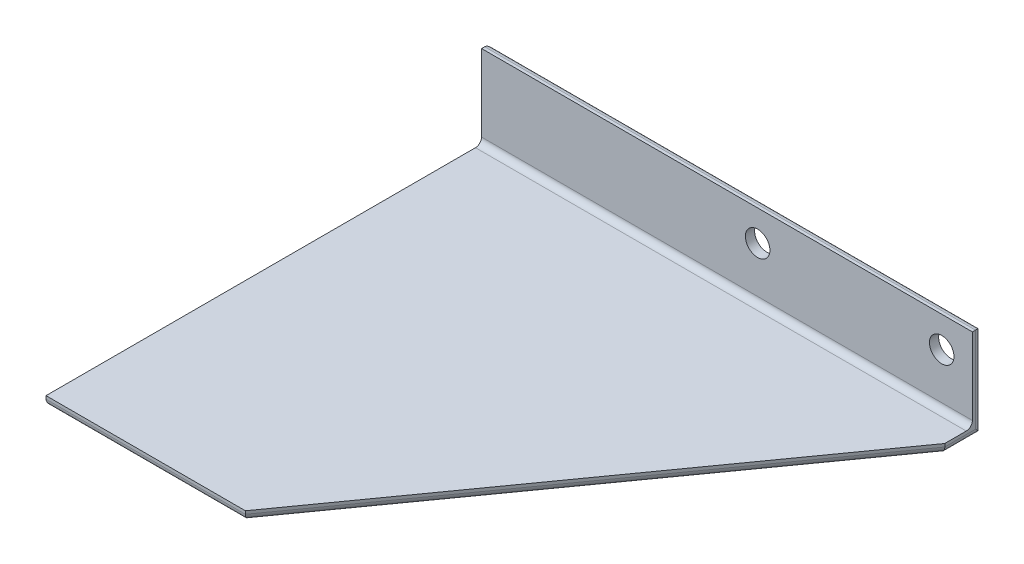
ISO-10303-21;
HEADER;
FILE_DESCRIPTION(('STEP AP214'),'2;1');
FILE_NAME('part.step','',(''),(''),'','','');
FILE_SCHEMA(('AUTOMOTIVE_DESIGN { 1 0 10303 214 1 1 1 1 }'));
ENDSEC;
DATA;
#1=APPLICATION_CONTEXT('core data for automotive mechanical design processes');
#2=APPLICATION_PROTOCOL_DEFINITION('international standard','automotive_design',2000,#1);
#3=PRODUCT_CONTEXT('',#1,'mechanical');
#4=PRODUCT('Part','Part','',(#3));
#5=PRODUCT_RELATED_PRODUCT_CATEGORY('part','',(#4));
#6=PRODUCT_DEFINITION_FORMATION('','',#4);
#7=PRODUCT_DEFINITION_CONTEXT('part definition',#1,'design');
#8=PRODUCT_DEFINITION('design','',#6,#7);
#9=PRODUCT_DEFINITION_SHAPE('','',#8);
#10=(LENGTH_UNIT() NAMED_UNIT(*) SI_UNIT(.MILLI.,.METRE.));
#11=(NAMED_UNIT(*) PLANE_ANGLE_UNIT() SI_UNIT($,.RADIAN.));
#12=(NAMED_UNIT(*) SI_UNIT($,.STERADIAN.) SOLID_ANGLE_UNIT());
#13=UNCERTAINTY_MEASURE_WITH_UNIT(LENGTH_MEASURE(1.E-05),#10,'distance_accuracy_value','');
#14=(GEOMETRIC_REPRESENTATION_CONTEXT(3) GLOBAL_UNCERTAINTY_ASSIGNED_CONTEXT((#13)) GLOBAL_UNIT_ASSIGNED_CONTEXT((#10,
#11,#12)) REPRESENTATION_CONTEXT('',''));
#15=CARTESIAN_POINT('',(0.,0.,0.));
#16=DIRECTION('',(0.,0.,1.));
#17=DIRECTION('',(1.,0.,0.));
#18=AXIS2_PLACEMENT_3D('',#15,#16,#17);
#19=CARTESIAN_POINT('',(0.,30.,3.));
#20=DIRECTION('',(0.,0.,-1.));
#21=DIRECTION('',(-1.,0.,0.));
#22=AXIS2_PLACEMENT_3D('',#19,#20,#21);
#23=PLANE('',#22);
#24=CARTESIAN_POINT('',(90.,20.,3.));
#25=DIRECTION('',(0.,0.,1.));
#26=DIRECTION('',(1.,0.,0.));
#27=AXIS2_PLACEMENT_3D('',#24,#25,#26);
#28=CIRCLE('',#27,4.);
#29=CARTESIAN_POINT('',(94.,20.,3.));
#30=VERTEX_POINT('',#29);
#31=EDGE_CURVE('E215',#30,#30,#28,.T.);
#32=ORIENTED_EDGE('',*,*,#31,.F.);
#33=EDGE_LOOP('',(#32));
#34=FACE_BOUND('',#33,.T.);
#35=CARTESIAN_POINT('',(150.,20.,3.));
#36=DIRECTION('',(0.,0.,1.));
#37=DIRECTION('',(1.,0.,0.));
#38=AXIS2_PLACEMENT_3D('',#35,#36,#37);
#39=CIRCLE('',#38,4.);
#40=CARTESIAN_POINT('',(154.,20.,3.));
#41=VERTEX_POINT('',#40);
#42=EDGE_CURVE('E225',#41,#41,#39,.T.);
#43=ORIENTED_EDGE('',*,*,#42,.F.);
#44=EDGE_LOOP('',(#43));
#45=FACE_BOUND('',#44,.T.);
#46=DIRECTION('',(0.,-1.,0.));
#47=VECTOR('',#46,1.);
#48=CARTESIAN_POINT('',(0.,0.,3.));
#49=LINE('',#48,#47);
#50=CARTESIAN_POINT('',(0.,30.,3.));
#51=VERTEX_POINT('',#50);
#52=CARTESIAN_POINT('',(0.,5.,3.));
#53=VERTEX_POINT('',#52);
#54=EDGE_CURVE('E139',#51,#53,#49,.T.);
#55=ORIENTED_EDGE('',*,*,#54,.T.);
#56=DIRECTION('',(-1.,0.,0.));
#57=VECTOR('',#56,1.);
#58=CARTESIAN_POINT('',(160.,5.,3.));
#59=LINE('',#58,#57);
#60=CARTESIAN_POINT('',(160.,5.,3.));
#61=VERTEX_POINT('',#60);
#62=EDGE_CURVE('E185',#53,#61,#59,.F.);
#63=ORIENTED_EDGE('',*,*,#62,.T.);
#64=DIRECTION('',(0.,1.,0.));
#65=VECTOR('',#64,1.);
#66=CARTESIAN_POINT('',(160.,0.,3.));
#67=LINE('',#66,#65);
#68=CARTESIAN_POINT('',(160.,30.,3.));
#69=VERTEX_POINT('',#68);
#70=EDGE_CURVE('E148',#61,#69,#67,.T.);
#71=ORIENTED_EDGE('',*,*,#70,.T.);
#72=DIRECTION('',(-1.,0.,0.));
#73=VECTOR('',#72,1.);
#74=CARTESIAN_POINT('',(0.,30.,3.));
#75=LINE('',#74,#73);
#76=EDGE_CURVE('E176',#69,#51,#75,.T.);
#77=ORIENTED_EDGE('',*,*,#76,.T.);
#78=EDGE_LOOP('',(#55,#63,#71,#77));
#79=FACE_BOUND('',#78,.T.);
#80=ADVANCED_FACE('F17',(#34,#45,#79),#23,.F.);
#81=CARTESIAN_POINT('',(0.,0.,3.));
#82=DIRECTION('',(1.,0.,0.));
#83=DIRECTION('',(0.,0.,-1.));
#84=AXIS2_PLACEMENT_3D('',#81,#82,#83);
#85=PLANE('',#84);
#86=DIRECTION('',(0.,0.,-1.));
#87=VECTOR('',#86,1.);
#88=CARTESIAN_POINT('',(0.,30.,3.));
#89=LINE('',#88,#87);
#90=CARTESIAN_POINT('',(0.,30.,2.));
#91=VERTEX_POINT('',#90);
#92=EDGE_CURVE('E302',#51,#91,#89,.T.);
#93=ORIENTED_EDGE('',*,*,#92,.T.);
#94=DIRECTION('',(0.,-1.,0.));
#95=VECTOR('',#94,1.);
#96=CARTESIAN_POINT('',(0.,0.,2.));
#97=LINE('',#96,#95);
#98=CARTESIAN_POINT('',(0.,2.,2.));
#99=VERTEX_POINT('',#98);
#100=EDGE_CURVE('E157',#91,#99,#97,.T.);
#101=ORIENTED_EDGE('',*,*,#100,.T.);
#102=DIRECTION('',(0.,0.,-1.));
#103=VECTOR('',#102,1.);
#104=CARTESIAN_POINT('',(0.,2.,3.));
#105=LINE('',#104,#103);
#106=CARTESIAN_POINT('',(0.,2.,145.));
#107=VERTEX_POINT('',#106);
#108=EDGE_CURVE('E121',#99,#107,#105,.F.);
#109=ORIENTED_EDGE('',*,*,#108,.T.);
#110=DIRECTION('',(0.,1.,0.));
#111=VECTOR('',#110,1.);
#112=CARTESIAN_POINT('',(0.,0.,145.));
#113=LINE('',#112,#111);
#114=CARTESIAN_POINT('',(0.,3.,145.));
#115=VERTEX_POINT('',#114);
#116=EDGE_CURVE('E117',#107,#115,#113,.T.);
#117=ORIENTED_EDGE('',*,*,#116,.T.);
#118=DIRECTION('',(0.,0.,1.));
#119=VECTOR('',#118,1.);
#120=CARTESIAN_POINT('',(0.,3.,145.));
#121=LINE('',#120,#119);
#122=CARTESIAN_POINT('',(0.,3.,5.));
#123=VERTEX_POINT('',#122);
#124=EDGE_CURVE('E105',#123,#115,#121,.T.);
#125=ORIENTED_EDGE('',*,*,#124,.F.);
#126=CARTESIAN_POINT('',(0.,5.,5.));
#127=DIRECTION('',(1.,0.,0.));
#128=DIRECTION('',(0.,0.,-1.));
#129=AXIS2_PLACEMENT_3D('',#126,#127,#128);
#130=CIRCLE('',#129,2.);
#131=EDGE_CURVE('E25',#123,#53,#130,.T.);
#132=ORIENTED_EDGE('',*,*,#131,.T.);
#133=ORIENTED_EDGE('',*,*,#54,.F.);
#134=EDGE_LOOP('',(#93,#101,#109,#117,#125,#132,#133));
#135=FACE_BOUND('',#134,.T.);
#136=ADVANCED_FACE('F19',(#135),#85,.F.);
#137=CARTESIAN_POINT('',(0.,0.,3.));
#138=DIRECTION('',(0.,1.,0.));
#139=DIRECTION('',(0.,0.,1.));
#140=AXIS2_PLACEMENT_3D('',#137,#138,#139);
#141=PLANE('',#140);
#142=DIRECTION('',(1.,0.,0.));
#143=VECTOR('',#142,1.);
#144=CARTESIAN_POINT('',(0.,0.,143.));
#145=LINE('',#144,#143);
#146=CARTESIAN_POINT('',(63.9707642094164,0.,143.));
#147=VERTEX_POINT('',#146);
#148=CARTESIAN_POINT('',(2.,0.,143.));
#149=VERTEX_POINT('',#148);
#150=EDGE_CURVE('E168',#147,#149,#145,.F.);
#151=ORIENTED_EDGE('',*,*,#150,.T.);
#152=DIRECTION('',(0.,0.,-1.));
#153=VECTOR('',#152,1.);
#154=CARTESIAN_POINT('',(2.,0.,3.));
#155=LINE('',#154,#153);
#156=CARTESIAN_POINT('',(2.,0.,0.));
#157=VERTEX_POINT('',#156);
#158=EDGE_CURVE('E172',#149,#157,#155,.T.);
#159=ORIENTED_EDGE('',*,*,#158,.T.);
#160=DIRECTION('',(1.,0.,0.));
#161=VECTOR('',#160,1.);
#162=CARTESIAN_POINT('',(0.,0.,0.));
#163=LINE('',#162,#161);
#164=CARTESIAN_POINT('',(158.,0.,0.));
#165=VERTEX_POINT('',#164);
#166=EDGE_CURVE('E135',#157,#165,#163,.T.);
#167=ORIENTED_EDGE('',*,*,#166,.T.);
#168=DIRECTION('',(0.,0.,-1.));
#169=VECTOR('',#168,1.);
#170=CARTESIAN_POINT('',(158.,0.,3.));
#171=LINE('',#170,#169);
#172=CARTESIAN_POINT('',(158.,0.,11.3590698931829));
#173=VERTEX_POINT('',#172);
#174=EDGE_CURVE('E170',#165,#173,#171,.F.);
#175=ORIENTED_EDGE('',*,*,#174,.T.);
#176=DIRECTION('',(0.581238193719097,0.,-0.813733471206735));
#177=VECTOR('',#176,1.);
#178=CARTESIAN_POINT('',(63.3725330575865,0.,143.837523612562));
#179=LINE('',#178,#177);
#180=EDGE_CURVE('E166',#173,#147,#179,.F.);
#181=ORIENTED_EDGE('',*,*,#180,.T.);
#182=EDGE_LOOP('',(#151,#159,#167,#175,#181));
#183=FACE_BOUND('',#182,.T.);
#184=ADVANCED_FACE('F252',(#183),#141,.F.);
#185=CARTESIAN_POINT('',(160.,0.,3.));
#186=DIRECTION('',(-1.,0.,0.));
#187=DIRECTION('',(0.,0.,1.));
#188=AXIS2_PLACEMENT_3D('',#185,#186,#187);
#189=PLANE('',#188);
#190=DIRECTION('',(0.,1.,0.));
#191=VECTOR('',#190,1.);
#192=CARTESIAN_POINT('',(160.,0.,12.));
#193=LINE('',#192,#191);
#194=CARTESIAN_POINT('',(160.,2.,12.));
#195=VERTEX_POINT('',#194);
#196=CARTESIAN_POINT('',(160.,3.,12.));
#197=VERTEX_POINT('',#196);
#198=EDGE_CURVE('E133',#195,#197,#193,.T.);
#199=ORIENTED_EDGE('',*,*,#198,.F.);
#200=DIRECTION('',(0.,0.,-1.));
#201=VECTOR('',#200,1.);
#202=CARTESIAN_POINT('',(160.,2.,3.));
#203=LINE('',#202,#201);
#204=CARTESIAN_POINT('',(160.,2.,2.));
#205=VERTEX_POINT('',#204);
#206=EDGE_CURVE('E40',#195,#205,#203,.T.);
#207=ORIENTED_EDGE('',*,*,#206,.T.);
#208=DIRECTION('',(0.,1.,0.));
#209=VECTOR('',#208,1.);
#210=CARTESIAN_POINT('',(160.,30.,2.));
#211=LINE('',#210,#209);
#212=CARTESIAN_POINT('',(160.,30.,2.));
#213=VERTEX_POINT('',#212);
#214=EDGE_CURVE('E174',#205,#213,#211,.T.);
#215=ORIENTED_EDGE('',*,*,#214,.T.);
#216=DIRECTION('',(0.,0.,-1.));
#217=VECTOR('',#216,1.);
#218=CARTESIAN_POINT('',(160.,30.,3.));
#219=LINE('',#218,#217);
#220=EDGE_CURVE('E149',#69,#213,#219,.T.);
#221=ORIENTED_EDGE('',*,*,#220,.F.);
#222=ORIENTED_EDGE('',*,*,#70,.F.);
#223=CARTESIAN_POINT('',(160.,5.,5.));
#224=DIRECTION('',(-1.,0.,0.));
#225=DIRECTION('',(0.,0.,1.));
#226=AXIS2_PLACEMENT_3D('',#223,#224,#225);
#227=CIRCLE('',#226,2.);
#228=CARTESIAN_POINT('',(160.,3.,5.));
#229=VERTEX_POINT('',#228);
#230=EDGE_CURVE('E11',#61,#229,#227,.T.);
#231=ORIENTED_EDGE('',*,*,#230,.T.);
#232=DIRECTION('',(0.,0.,-1.));
#233=VECTOR('',#232,1.);
#234=CARTESIAN_POINT('',(160.,3.,3.));
#235=LINE('',#234,#233);
#236=EDGE_CURVE('E123',#197,#229,#235,.T.);
#237=ORIENTED_EDGE('',*,*,#236,.F.);
#238=EDGE_LOOP('',(#199,#207,#215,#221,#222,#231,#237));
#239=FACE_BOUND('',#238,.T.);
#240=ADVANCED_FACE('F196',(#239),#189,.F.);
#241=CARTESIAN_POINT('',(0.,30.,3.));
#242=DIRECTION('',(0.,-1.,0.));
#243=DIRECTION('',(0.,0.,-1.));
#244=AXIS2_PLACEMENT_3D('',#241,#242,#243);
#245=PLANE('',#244);
#246=ORIENTED_EDGE('',*,*,#220,.T.);
#247=DIRECTION('',(-1.,0.,0.));
#248=VECTOR('',#247,1.);
#249=CARTESIAN_POINT('',(0.,30.,2.));
#250=LINE('',#249,#248);
#251=EDGE_CURVE('E179',#213,#91,#250,.T.);
#252=ORIENTED_EDGE('',*,*,#251,.T.);
#253=ORIENTED_EDGE('',*,*,#92,.F.);
#254=ORIENTED_EDGE('',*,*,#76,.F.);
#255=EDGE_LOOP('',(#246,#252,#253,#254));
#256=FACE_BOUND('',#255,.T.);
#257=ADVANCED_FACE('F258',(#256),#245,.F.);
#258=CARTESIAN_POINT('',(0.,30.,0.));
#259=DIRECTION('',(0.,0.,-1.));
#260=DIRECTION('',(-1.,0.,0.));
#261=AXIS2_PLACEMENT_3D('',#258,#259,#260);
#262=PLANE('',#261);
#263=ORIENTED_EDGE('',*,*,#166,.F.);
#264=DIRECTION('',(0.,-1.,0.));
#265=VECTOR('',#264,1.);
#266=CARTESIAN_POINT('',(2.,30.,0.));
#267=LINE('',#266,#265);
#268=CARTESIAN_POINT('',(2.,28.,0.));
#269=VERTEX_POINT('',#268);
#270=EDGE_CURVE('E163',#157,#269,#267,.F.);
#271=ORIENTED_EDGE('',*,*,#270,.T.);
#272=DIRECTION('',(-1.,0.,0.));
#273=VECTOR('',#272,1.);
#274=CARTESIAN_POINT('',(160.,28.,0.));
#275=LINE('',#274,#273);
#276=CARTESIAN_POINT('',(158.,28.,0.));
#277=VERTEX_POINT('',#276);
#278=EDGE_CURVE('E159',#269,#277,#275,.F.);
#279=ORIENTED_EDGE('',*,*,#278,.T.);
#280=DIRECTION('',(0.,1.,0.));
#281=VECTOR('',#280,1.);
#282=CARTESIAN_POINT('',(158.,0.,0.));
#283=LINE('',#282,#281);
#284=EDGE_CURVE('E161',#277,#165,#283,.F.);
#285=ORIENTED_EDGE('',*,*,#284,.T.);
#286=EDGE_LOOP('',(#263,#271,#279,#285));
#287=FACE_BOUND('',#286,.T.);
#288=CARTESIAN_POINT('',(90.,20.,0.));
#289=DIRECTION('',(0.,0.,1.));
#290=DIRECTION('',(1.,0.,0.));
#291=AXIS2_PLACEMENT_3D('',#288,#289,#290);
#292=CIRCLE('',#291,4.);
#293=CARTESIAN_POINT('',(94.,20.,0.));
#294=VERTEX_POINT('',#293);
#295=EDGE_CURVE('E218',#294,#294,#292,.T.);
#296=ORIENTED_EDGE('',*,*,#295,.T.);
#297=EDGE_LOOP('',(#296));
#298=FACE_BOUND('',#297,.T.);
#299=CARTESIAN_POINT('',(150.,20.,0.));
#300=DIRECTION('',(0.,0.,1.));
#301=DIRECTION('',(1.,0.,0.));
#302=AXIS2_PLACEMENT_3D('',#299,#300,#301);
#303=CIRCLE('',#302,4.);
#304=CARTESIAN_POINT('',(154.,20.,0.));
#305=VERTEX_POINT('',#304);
#306=EDGE_CURVE('E115',#305,#305,#303,.T.);
#307=ORIENTED_EDGE('',*,*,#306,.T.);
#308=EDGE_LOOP('',(#307));
#309=FACE_BOUND('',#308,.T.);
#310=ADVANCED_FACE('F232',(#287,#298,#309),#262,.T.);
#311=CARTESIAN_POINT('',(160.,0.,12.));
#312=DIRECTION('',(0.813733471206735,0.,0.581238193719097));
#313=DIRECTION('',(0.581238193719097,0.,-0.813733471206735));
#314=AXIS2_PLACEMENT_3D('',#311,#312,#313);
#315=PLANE('',#314);
#316=DIRECTION('',(0.,1.,0.));
#317=VECTOR('',#316,1.);
#318=CARTESIAN_POINT('',(65.,0.,145.));
#319=LINE('',#318,#317);
#320=CARTESIAN_POINT('',(65.,2.,145.));
#321=VERTEX_POINT('',#320);
#322=CARTESIAN_POINT('',(65.,3.,145.));
#323=VERTEX_POINT('',#322);
#324=EDGE_CURVE('E122',#321,#323,#319,.T.);
#325=ORIENTED_EDGE('',*,*,#324,.F.);
#326=DIRECTION('',(0.581238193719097,0.,-0.813733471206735));
#327=VECTOR('',#326,1.);
#328=CARTESIAN_POINT('',(160.,2.,12.));
#329=LINE('',#328,#327);
#330=EDGE_CURVE('E182',#321,#195,#329,.T.);
#331=ORIENTED_EDGE('',*,*,#330,.T.);
#332=ORIENTED_EDGE('',*,*,#198,.T.);
#333=DIRECTION('',(0.581238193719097,0.,-0.813733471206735));
#334=VECTOR('',#333,1.);
#335=CARTESIAN_POINT('',(160.,3.,12.));
#336=LINE('',#335,#334);
#337=EDGE_CURVE('E127',#323,#197,#336,.T.);
#338=ORIENTED_EDGE('',*,*,#337,.F.);
#339=EDGE_LOOP('',(#325,#331,#332,#338));
#340=FACE_BOUND('',#339,.T.);
#341=ADVANCED_FACE('F199',(#340),#315,.T.);
#342=CARTESIAN_POINT('',(65.,0.,145.));
#343=DIRECTION('',(0.,0.,1.));
#344=DIRECTION('',(1.,0.,0.));
#345=AXIS2_PLACEMENT_3D('',#342,#343,#344);
#346=PLANE('',#345);
#347=ORIENTED_EDGE('',*,*,#116,.F.);
#348=DIRECTION('',(1.,0.,0.));
#349=VECTOR('',#348,1.);
#350=CARTESIAN_POINT('',(65.,2.,145.));
#351=LINE('',#350,#349);
#352=EDGE_CURVE('E32',#107,#321,#351,.T.);
#353=ORIENTED_EDGE('',*,*,#352,.T.);
#354=ORIENTED_EDGE('',*,*,#324,.T.);
#355=DIRECTION('',(1.,0.,0.));
#356=VECTOR('',#355,1.);
#357=CARTESIAN_POINT('',(65.,3.,145.));
#358=LINE('',#357,#356);
#359=EDGE_CURVE('E111',#115,#323,#358,.T.);
#360=ORIENTED_EDGE('',*,*,#359,.F.);
#361=EDGE_LOOP('',(#347,#353,#354,#360));
#362=FACE_BOUND('',#361,.T.);
#363=ADVANCED_FACE('F125',(#362),#346,.T.);
#364=CARTESIAN_POINT('',(160.,3.,3.));
#365=DIRECTION('',(0.,-1.,0.));
#366=DIRECTION('',(0.,0.,-1.));
#367=AXIS2_PLACEMENT_3D('',#364,#365,#366);
#368=PLANE('',#367);
#369=ORIENTED_EDGE('',*,*,#236,.T.);
#370=DIRECTION('',(-1.,0.,0.));
#371=VECTOR('',#370,1.);
#372=CARTESIAN_POINT('',(0.,3.,5.));
#373=LINE('',#372,#371);
#374=EDGE_CURVE('E113',#229,#123,#373,.T.);
#375=ORIENTED_EDGE('',*,*,#374,.T.);
#376=ORIENTED_EDGE('',*,*,#124,.T.);
#377=ORIENTED_EDGE('',*,*,#359,.T.);
#378=ORIENTED_EDGE('',*,*,#337,.T.);
#379=EDGE_LOOP('',(#369,#375,#376,#377,#378));
#380=FACE_BOUND('',#379,.T.);
#381=ADVANCED_FACE('F108',(#380),#368,.F.);
#382=CARTESIAN_POINT('',(150.,20.,0.));
#383=DIRECTION('',(0.,0.,1.));
#384=DIRECTION('',(1.,0.,0.));
#385=AXIS2_PLACEMENT_3D('',#382,#383,#384);
#386=CYLINDRICAL_SURFACE('',#385,4.);
#387=ORIENTED_EDGE('',*,*,#306,.F.);
#388=EDGE_LOOP('',(#387));
#389=FACE_BOUND('',#388,.T.);
#390=ORIENTED_EDGE('',*,*,#42,.T.);
#391=EDGE_LOOP('',(#390));
#392=FACE_BOUND('',#391,.T.);
#393=ADVANCED_FACE('F234',(#389,#392),#386,.F.);
#394=CARTESIAN_POINT('',(90.,20.,0.));
#395=DIRECTION('',(0.,0.,1.));
#396=DIRECTION('',(1.,0.,0.));
#397=AXIS2_PLACEMENT_3D('',#394,#395,#396);
#398=CYLINDRICAL_SURFACE('',#397,4.);
#399=ORIENTED_EDGE('',*,*,#295,.F.);
#400=EDGE_LOOP('',(#399));
#401=FACE_BOUND('',#400,.T.);
#402=ORIENTED_EDGE('',*,*,#31,.T.);
#403=EDGE_LOOP('',(#402));
#404=FACE_BOUND('',#403,.T.);
#405=ADVANCED_FACE('F236',(#401,#404),#398,.F.);
#406=CARTESIAN_POINT('',(158.,2.,3.));
#407=DIRECTION('',(0.,0.,-1.));
#408=DIRECTION('',(-1.,0.,0.));
#409=AXIS2_PLACEMENT_3D('',#406,#407,#408);
#410=CYLINDRICAL_SURFACE('',#409,2.);
#411=CARTESIAN_POINT('',(158.,2.,2.));
#412=DIRECTION('',(0.,-0.707106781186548,0.707106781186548));
#413=DIRECTION('',(0.,-0.707106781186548,-0.707106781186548));
#414=AXIS2_PLACEMENT_3D('',#411,#412,#413);
#415=ELLIPSE('',#414,2.82842712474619,2.);
#416=EDGE_CURVE('E209',#205,#165,#415,.F.);
#417=ORIENTED_EDGE('',*,*,#416,.F.);
#418=ORIENTED_EDGE('',*,*,#206,.F.);
#419=CARTESIAN_POINT('',(158.,2.,11.3590698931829));
#420=DIRECTION('',(-0.305177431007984,0.,0.952295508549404));
#421=DIRECTION('',(-0.952295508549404,0.,-0.305177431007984));
#422=AXIS2_PLACEMENT_3D('',#419,#420,#421);
#423=ELLIPSE('',#422,2.10018842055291,2.);
#424=EDGE_CURVE('E206',#173,#195,#423,.T.);
#425=ORIENTED_EDGE('',*,*,#424,.F.);
#426=ORIENTED_EDGE('',*,*,#174,.F.);
#427=EDGE_LOOP('',(#417,#418,#425,#426));
#428=FACE_BOUND('',#427,.T.);
#429=ADVANCED_FACE('F204',(#428),#410,.T.);
#430=CARTESIAN_POINT('',(158.372533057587,2.,10.8375236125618));
#431=DIRECTION('',(-0.581238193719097,0.,0.813733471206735));
#432=DIRECTION('',(0.813733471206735,0.,0.581238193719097));
#433=AXIS2_PLACEMENT_3D('',#430,#431,#432);
#434=CYLINDRICAL_SURFACE('',#433,2.);
#435=ORIENTED_EDGE('',*,*,#424,.T.);
#436=ORIENTED_EDGE('',*,*,#330,.F.);
#437=CARTESIAN_POINT('',(63.9707642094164,2.,143.));
#438=DIRECTION('',(-0.88916764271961,0.,0.45758158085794));
#439=DIRECTION('',(0.45758158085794,0.,0.88916764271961));
#440=AXIS2_PLACEMENT_3D('',#437,#438,#439);
#441=ELLIPSE('',#440,2.24929462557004,2.);
#442=EDGE_CURVE('E220',#147,#321,#441,.T.);
#443=ORIENTED_EDGE('',*,*,#442,.F.);
#444=ORIENTED_EDGE('',*,*,#180,.F.);
#445=EDGE_LOOP('',(#435,#436,#443,#444));
#446=FACE_BOUND('',#445,.T.);
#447=ADVANCED_FACE('F212',(#446),#434,.T.);
#448=CARTESIAN_POINT('',(158.,0.,2.));
#449=DIRECTION('',(0.,-1.,0.));
#450=DIRECTION('',(0.,0.,-1.));
#451=AXIS2_PLACEMENT_3D('',#448,#449,#450);
#452=CYLINDRICAL_SURFACE('',#451,2.);
#453=ORIENTED_EDGE('',*,*,#416,.T.);
#454=ORIENTED_EDGE('',*,*,#284,.F.);
#455=CARTESIAN_POINT('',(158.,28.,2.));
#456=DIRECTION('',(0.707106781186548,-0.707106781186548,0.));
#457=DIRECTION('',(0.707106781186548,0.707106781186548,0.));
#458=AXIS2_PLACEMENT_3D('',#455,#456,#457);
#459=ELLIPSE('',#458,2.82842712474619,2.);
#460=EDGE_CURVE('E277',#213,#277,#459,.F.);
#461=ORIENTED_EDGE('',*,*,#460,.F.);
#462=ORIENTED_EDGE('',*,*,#214,.F.);
#463=EDGE_LOOP('',(#453,#454,#461,#462));
#464=FACE_BOUND('',#463,.T.);
#465=ADVANCED_FACE('F298',(#464),#452,.T.);
#466=CARTESIAN_POINT('',(65.,2.,143.));
#467=DIRECTION('',(-1.,0.,0.));
#468=DIRECTION('',(0.,0.,1.));
#469=AXIS2_PLACEMENT_3D('',#466,#467,#468);
#470=CYLINDRICAL_SURFACE('',#469,2.);
#471=ORIENTED_EDGE('',*,*,#442,.T.);
#472=ORIENTED_EDGE('',*,*,#352,.F.);
#473=CARTESIAN_POINT('',(2.,2.,143.));
#474=DIRECTION('',(-0.707106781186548,0.,-0.707106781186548));
#475=DIRECTION('',(-0.707106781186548,0.,0.707106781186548));
#476=AXIS2_PLACEMENT_3D('',#473,#474,#475);
#477=ELLIPSE('',#476,2.82842712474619,2.);
#478=EDGE_CURVE('E274',#149,#107,#477,.T.);
#479=ORIENTED_EDGE('',*,*,#478,.F.);
#480=ORIENTED_EDGE('',*,*,#150,.F.);
#481=EDGE_LOOP('',(#471,#472,#479,#480));
#482=FACE_BOUND('',#481,.T.);
#483=ADVANCED_FACE('F275',(#482),#470,.T.);
#484=CARTESIAN_POINT('',(0.,28.,2.));
#485=DIRECTION('',(1.,0.,0.));
#486=DIRECTION('',(0.,0.,-1.));
#487=AXIS2_PLACEMENT_3D('',#484,#485,#486);
#488=CYLINDRICAL_SURFACE('',#487,2.);
#489=ORIENTED_EDGE('',*,*,#460,.T.);
#490=ORIENTED_EDGE('',*,*,#278,.F.);
#491=CARTESIAN_POINT('',(2.,28.,2.));
#492=DIRECTION('',(0.707106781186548,0.707106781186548,0.));
#493=DIRECTION('',(0.707106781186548,-0.707106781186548,0.));
#494=AXIS2_PLACEMENT_3D('',#491,#492,#493);
#495=ELLIPSE('',#494,2.82842712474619,2.);
#496=EDGE_CURVE('E278',#91,#269,#495,.F.);
#497=ORIENTED_EDGE('',*,*,#496,.F.);
#498=ORIENTED_EDGE('',*,*,#251,.F.);
#499=EDGE_LOOP('',(#489,#490,#497,#498));
#500=FACE_BOUND('',#499,.T.);
#501=ADVANCED_FACE('F294',(#500),#488,.T.);
#502=CARTESIAN_POINT('',(2.,2.,3.));
#503=DIRECTION('',(0.,0.,-1.));
#504=DIRECTION('',(-1.,0.,0.));
#505=AXIS2_PLACEMENT_3D('',#502,#503,#504);
#506=CYLINDRICAL_SURFACE('',#505,2.);
#507=ORIENTED_EDGE('',*,*,#478,.T.);
#508=ORIENTED_EDGE('',*,*,#108,.F.);
#509=CARTESIAN_POINT('',(2.,2.,2.));
#510=DIRECTION('',(0.,0.707106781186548,-0.707106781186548));
#511=DIRECTION('',(0.,-0.707106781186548,-0.707106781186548));
#512=AXIS2_PLACEMENT_3D('',#509,#510,#511);
#513=ELLIPSE('',#512,2.82842712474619,2.);
#514=EDGE_CURVE('E282',#157,#99,#513,.T.);
#515=ORIENTED_EDGE('',*,*,#514,.F.);
#516=ORIENTED_EDGE('',*,*,#158,.F.);
#517=EDGE_LOOP('',(#507,#508,#515,#516));
#518=FACE_BOUND('',#517,.T.);
#519=ADVANCED_FACE('F281',(#518),#506,.T.);
#520=CARTESIAN_POINT('',(2.,0.,2.));
#521=DIRECTION('',(0.,1.,0.));
#522=DIRECTION('',(0.,0.,1.));
#523=AXIS2_PLACEMENT_3D('',#520,#521,#522);
#524=CYLINDRICAL_SURFACE('',#523,2.);
#525=ORIENTED_EDGE('',*,*,#496,.T.);
#526=ORIENTED_EDGE('',*,*,#270,.F.);
#527=ORIENTED_EDGE('',*,*,#514,.T.);
#528=ORIENTED_EDGE('',*,*,#100,.F.);
#529=EDGE_LOOP('',(#525,#526,#527,#528));
#530=FACE_BOUND('',#529,.T.);
#531=ADVANCED_FACE('F301',(#530),#524,.T.);
#532=CARTESIAN_POINT('',(160.,5.,5.));
#533=DIRECTION('',(1.,0.,0.));
#534=DIRECTION('',(0.,0.,-1.));
#535=AXIS2_PLACEMENT_3D('',#532,#533,#534);
#536=CYLINDRICAL_SURFACE('',#535,2.);
#537=ORIENTED_EDGE('',*,*,#230,.F.);
#538=ORIENTED_EDGE('',*,*,#62,.F.);
#539=ORIENTED_EDGE('',*,*,#131,.F.);
#540=ORIENTED_EDGE('',*,*,#374,.F.);
#541=EDGE_LOOP('',(#537,#538,#539,#540));
#542=FACE_BOUND('',#541,.T.);
#543=ADVANCED_FACE('F194',(#542),#536,.F.);
#544=CLOSED_SHELL('',(#80,#136,#184,#240,#257,#310,#341,#363,#381,#393,#405,#429,#447,#465,#483,
#501,#519,#531,#543));
#545=MANIFOLD_SOLID_BREP('B1',#544);
#546=ADVANCED_BREP_SHAPE_REPRESENTATION('',(#18,#545),#14);
#547=SHAPE_DEFINITION_REPRESENTATION(#9,#546);
ENDSEC;
END-ISO-10303-21;
